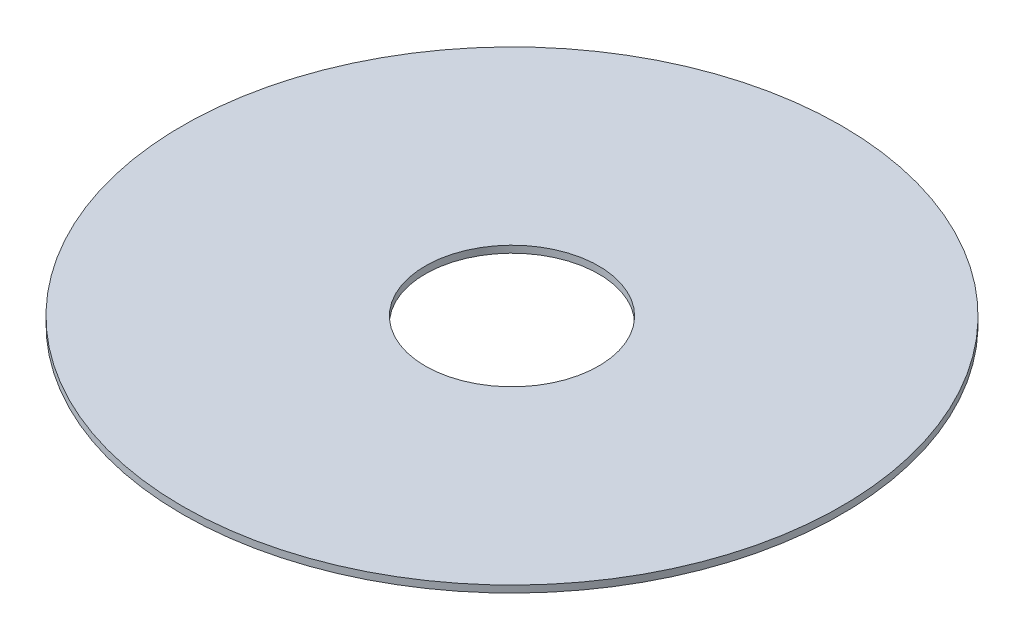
from build123d import *

# Parameters (mm, degrees)
SKETCH1_R           = 47.5
BOSS_EXTRUDE1_DEPTH = 1
SKETCH2_R           = 12.5
CUT_EXTRUDE1_DEPTH  = 1


with BuildPart() as part:
    # Sketch1 → Boss-Extrude1 (new body)
    with BuildSketch(Plane(origin=(0, 0, 0), x_dir=(1, 0, 0), z_dir=(0, 1, 0))):
        with Locations(Location((0, 0, 0), (0, 0, 270))):
            Circle(SKETCH1_R)
    extrude(amount=BOSS_EXTRUDE1_DEPTH)

    # Sketch2 → Cut-Extrude1 (cut)
    with BuildSketch(Plane(origin=(0, 1, 0), x_dir=(1, 0, 0), z_dir=(0, 1, 0))):
        with Locations(Location((0, 0, 0), (0, 0, 270))):
            Circle(SKETCH2_R)
    extrude(amount=-CUT_EXTRUDE1_DEPTH, mode=Mode.SUBTRACT)


solid = part.part
